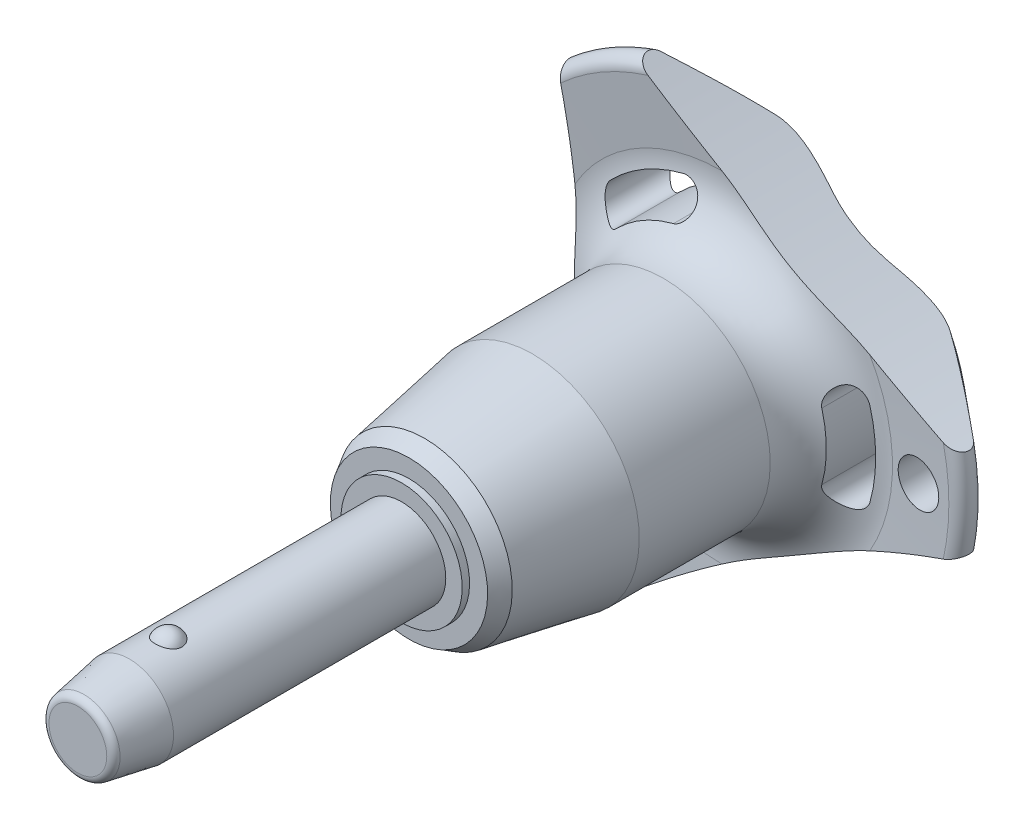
from build123d import *

# Parameters (mm, degrees)
SKETCH1_R           = 3
BOSS_EXTRUDE1_DEPTH = 15
SKETCH2_R           = 2.5
BOSS_EXTRUDE2_DEPTH = 26.7
BOSS_EXTRUDE3_START = 7
SKETCH1_2_R         = 3
BOSS_EXTRUDE3_DEPTH = 7
CHAMFER1_SIZE       = 3.5
CHAMFER1_SIZE2      = 0.617144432
FILLET1_R           = 0.5
SKETCH6_R           = 79.96
CUT_EXTRUDE1_DEPTH  = 48.854696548
CIRPATTERN1_COUNT   = 3
SKETCH7_R           = 1.5
CUT_EXTRUDE2_DEPTH  = 48.535566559


with BuildPart() as part:
    # Sketch1 → Boss-Extrude1 (new body)
    with BuildSketch(Plane.XY):
        Circle(SKETCH1_R)
    extrude(amount=-BOSS_EXTRUDE1_DEPTH)

    # Sketch2 → Boss-Extrude2 (add)
    with BuildSketch(Plane(origin=(0, 0, -15), x_dir=(-1, 0, 0), z_dir=(0, 0, -1))):
        Circle(SKETCH2_R)
    extrude(amount=BOSS_EXTRUDE2_DEPTH)

    # Sketch3 → Revolve1 (revolve)
    with BuildSketch(Plane(origin=(0, 0, 0), x_dir=(0, 0, -1), z_dir=(1, 0, 0))):
        with BuildLine():
            Line((-0.866025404, 3.5), (-0.866025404, 1.5))
            ThreePointArc((-0.866025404, 1.5), (0.133974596, 2.5), (-0.866025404, 3.5))
        make_face()
        with BuildLine():
            Line((-0.866025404, -1.5), (-0.866025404, -3.5))
            ThreePointArc((-0.866025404, -3.5), (0.133974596, -2.5), (-0.866025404, -1.5))
        make_face()
    revolve(axis=Axis((0, -1.5, 0.866025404), (0, 1, 0)))

    # Sketch1_2 → Boss-Extrude3 (add)
    with BuildSketch(Plane.XY.offset(BOSS_EXTRUDE3_START)):
        Circle(SKETCH1_2_R)
    extrude(amount=-BOSS_EXTRUDE3_DEPTH)

    # Chamfer1
    chamfer1_edges = [part.edges().sort_by_distance(p)[0] for p in [
        (-3, 0, 7),
    ]]
    chamfer1_side = [part.faces().sort_by_distance(p)[0] for p in [
        (-3, 0, -4),
    ]]
    chamfer(chamfer1_edges, length=CHAMFER1_SIZE, length2=CHAMFER1_SIZE2, reference=chamfer1_side[0])

    # Fillet1
    fillet1_edges = [part.edges().sort_by_distance(p)[0] for p in [
        (-2.382855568, 0, 7),
        (2.5, 0, -41.7),
    ]]
    fillet(fillet1_edges, radius=FILLET1_R)

    # Sketch4 → Revolve2 (revolve)
    with BuildSketch(Plane(origin=(0, 0, 0), x_dir=(0, 0, -1), z_dir=(1, 0, 0))):
        Polygon((15, 0), (15, 4.118359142), (15.5, 4.118359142), (15.5, 5.343400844), (16.560917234, 5.955921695), (23.9, 7.25), (32.8, 7.25), (32.8, 0), align=None)
    revolve(axis=Axis((0, 0, -32.8), (0, 0, 1)))

    # Sketch5 → Revolve3 (revolve)
    with BuildSketch(Plane(origin=(0, 0, 0), x_dir=(0, 0, -1), z_dir=(1, 0, 0)), mode=Mode.PRIVATE) as revolve3_sk:
        with BuildLine():
            Line((36.78715932, 11.570250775), (36.452568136, 15.735949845))
            ThreePointArc((36.452568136, 15.735949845), (36.946485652, 16.540188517), (37.862835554, 16.314230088))
            Line((37.862835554, 16.314230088), (41.326414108, 12.186497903))
            ThreePointArc((41.326414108, 12.186497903), (41.7, 11.109282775), (41.261488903, 10.056825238))
            ThreePointArc((41.261488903, 10.056825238), (38.289873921, 5.413681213), (37.25, 0))
            Line((37.25, 0), (32.8, 0))
            Line((32.8, 0), (32.8, 7.25))
            ThreePointArc((32.8, 7.25), (35.739473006, 8.537160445), (36.78715932, 11.570250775))
        make_face()
    revolve(revolve3_sk.sketch.rotate(Axis((0, 0, -37.25), (0, 0, 1)), 90), axis=Axis((0, 0, -37.25), (0, 0, 1)))

    # Sketch6 → Cut-Extrude1 (cut, through all)
    with BuildSketch(Plane.XY):
        with Locations((-89.76, 0)):
            Circle(SKETCH6_R)
        with BuildLine():
            ThreePointArc((10.099921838, -2.834717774), (10.490188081, 0), (10.099921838, 2.834717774))
            ThreePointArc((10.099921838, 2.834717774), (8.768180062, 3.582738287), (8.020159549, 2.250996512))
            ThreePointArc((8.020159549, 2.250996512), (8.330062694, 0), (8.020159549, -2.250996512))
            ThreePointArc((8.020159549, -2.250996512), (8.768180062, -3.582738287), (10.099921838, -2.834717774))
        make_face()
    cut_extrude1 = extrude(amount=-CUT_EXTRUDE1_DEPTH, mode=Mode.SUBTRACT)

    # CirPattern1: Cut-Extrude1 ×3 about axis
    cirpattern1_axis = Axis((0, 0, 0), (0, 0, 1))
    for i in range(1, CIRPATTERN1_COUNT):
        add(cut_extrude1.rotate(cirpattern1_axis, i * 360 / CIRPATTERN1_COUNT), mode=Mode.SUBTRACT)

    # Sketch7 → Cut-Extrude2 (cut, through all)
    with BuildSketch(Plane.XY):
        with Locations(Location((13.490188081, 0, 0), (0, 0, 225.221865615))):
            Circle(SKETCH7_R)
    extrude(amount=-CUT_EXTRUDE2_DEPTH, mode=Mode.SUBTRACT)


solid = part.part
